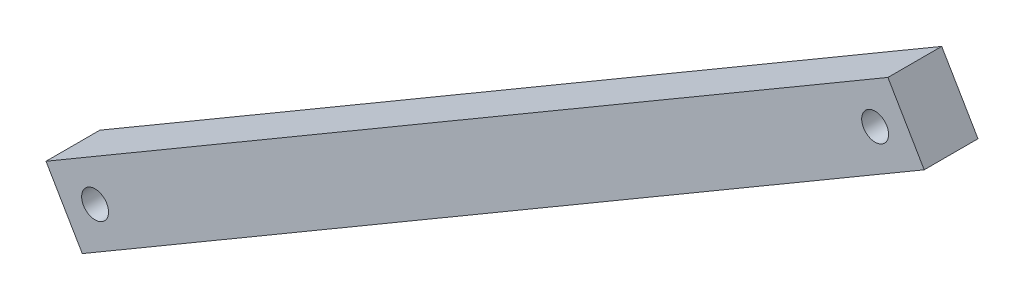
ISO-10303-21;
HEADER;
FILE_DESCRIPTION(('STEP AP214'),'2;1');
FILE_NAME('part.step','',(''),(''),'','','');
FILE_SCHEMA(('AUTOMOTIVE_DESIGN { 1 0 10303 214 1 1 1 1 }'));
ENDSEC;
DATA;
#1=APPLICATION_CONTEXT('core data for automotive mechanical design processes');
#2=APPLICATION_PROTOCOL_DEFINITION('international standard','automotive_design',2000,#1);
#3=PRODUCT_CONTEXT('',#1,'mechanical');
#4=PRODUCT('Part','Part','',(#3));
#5=PRODUCT_RELATED_PRODUCT_CATEGORY('part','',(#4));
#6=PRODUCT_DEFINITION_FORMATION('','',#4);
#7=PRODUCT_DEFINITION_CONTEXT('part definition',#1,'design');
#8=PRODUCT_DEFINITION('design','',#6,#7);
#9=PRODUCT_DEFINITION_SHAPE('','',#8);
#10=(LENGTH_UNIT() NAMED_UNIT(*) SI_UNIT(.MILLI.,.METRE.));
#11=(NAMED_UNIT(*) PLANE_ANGLE_UNIT() SI_UNIT($,.RADIAN.));
#12=(NAMED_UNIT(*) SI_UNIT($,.STERADIAN.) SOLID_ANGLE_UNIT());
#13=UNCERTAINTY_MEASURE_WITH_UNIT(LENGTH_MEASURE(1.E-05),#10,'distance_accuracy_value','');
#14=(GEOMETRIC_REPRESENTATION_CONTEXT(3) GLOBAL_UNCERTAINTY_ASSIGNED_CONTEXT((#13)) GLOBAL_UNIT_ASSIGNED_CONTEXT((#10,
#11,#12)) REPRESENTATION_CONTEXT('',''));
#15=CARTESIAN_POINT('',(0.,0.,0.));
#16=DIRECTION('',(0.,0.,1.));
#17=DIRECTION('',(1.,0.,0.));
#18=AXIS2_PLACEMENT_3D('',#15,#16,#17);
#19=CARTESIAN_POINT('',(-1.42791388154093,30.5263301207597,6.));
#20=DIRECTION('',(0.,0.,-1.));
#21=DIRECTION('',(-1.,0.,0.));
#22=AXIS2_PLACEMENT_3D('',#19,#20,#21);
#23=PLANE('',#22);
#24=CARTESIAN_POINT('',(87.,87.,6.));
#25=DIRECTION('',(0.,0.,1.));
#26=DIRECTION('',(1.,0.,0.));
#27=AXIS2_PLACEMENT_3D('',#24,#25,#26);
#28=CIRCLE('',#27,1.5);
#29=CARTESIAN_POINT('',(88.5,87.,6.));
#30=VERTEX_POINT('',#29);
#31=EDGE_CURVE('E85',#30,#30,#28,.T.);
#32=ORIENTED_EDGE('',*,*,#31,.F.);
#33=EDGE_LOOP('',(#32));
#34=FACE_BOUND('',#33,.T.);
#35=DIRECTION('',(0.505719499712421,-0.862697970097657,0.));
#36=VECTOR('',#35,1.);
#37=CARTESIAN_POINT('',(-5.47366987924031,37.427913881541,6.));
#38=LINE('',#37,#36);
#39=CARTESIAN_POINT('',(-5.47366987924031,37.427913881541,6.));
#40=VERTEX_POINT('',#39);
#41=CARTESIAN_POINT('',(-1.42791388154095,30.5263301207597,6.));
#42=VERTEX_POINT('',#41);
#43=EDGE_CURVE('E95',#40,#42,#38,.T.);
#44=ORIENTED_EDGE('',*,*,#43,.T.);
#45=DIRECTION('',(0.862697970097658,0.50571949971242,0.));
#46=VECTOR('',#45,1.);
#47=CARTESIAN_POINT('',(92.4736698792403,85.5720861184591,6.));
#48=LINE('',#47,#46);
#49=CARTESIAN_POINT('',(92.4736698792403,85.5720861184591,6.));
#50=VERTEX_POINT('',#49);
#51=EDGE_CURVE('E80',#42,#50,#48,.T.);
#52=ORIENTED_EDGE('',*,*,#51,.T.);
#53=DIRECTION('',(-0.50571949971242,0.862697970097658,0.));
#54=VECTOR('',#53,1.);
#55=CARTESIAN_POINT('',(88.427913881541,92.4736698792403,6.));
#56=LINE('',#55,#54);
#57=CARTESIAN_POINT('',(88.427913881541,92.4736698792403,6.));
#58=VERTEX_POINT('',#57);
#59=EDGE_CURVE('E46',#50,#58,#56,.T.);
#60=ORIENTED_EDGE('',*,*,#59,.T.);
#61=DIRECTION('',(-0.862697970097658,-0.50571949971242,0.));
#62=VECTOR('',#61,1.);
#63=CARTESIAN_POINT('',(-5.47366987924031,37.427913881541,6.));
#64=LINE('',#63,#62);
#65=EDGE_CURVE('E41',#58,#40,#64,.T.);
#66=ORIENTED_EDGE('',*,*,#65,.T.);
#67=EDGE_LOOP('',(#44,#52,#60,#66));
#68=FACE_BOUND('',#67,.T.);
#69=CARTESIAN_POINT('',(0.,36.,6.));
#70=DIRECTION('',(0.,0.,1.));
#71=DIRECTION('',(1.,0.,0.));
#72=AXIS2_PLACEMENT_3D('',#69,#70,#71);
#73=CIRCLE('',#72,1.5);
#74=CARTESIAN_POINT('',(1.5,36.,6.));
#75=VERTEX_POINT('',#74);
#76=EDGE_CURVE('E113',#75,#75,#73,.T.);
#77=ORIENTED_EDGE('',*,*,#76,.F.);
#78=EDGE_LOOP('',(#77));
#79=FACE_BOUND('',#78,.T.);
#80=ADVANCED_FACE('F26',(#34,#68,#79),#23,.F.);
#81=CARTESIAN_POINT('',(-1.42791388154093,30.5263301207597,0.));
#82=DIRECTION('',(0.,0.,-1.));
#83=DIRECTION('',(-1.,0.,0.));
#84=AXIS2_PLACEMENT_3D('',#81,#82,#83);
#85=PLANE('',#84);
#86=CARTESIAN_POINT('',(87.,87.,0.));
#87=DIRECTION('',(0.,0.,1.));
#88=DIRECTION('',(1.,0.,0.));
#89=AXIS2_PLACEMENT_3D('',#86,#87,#88);
#90=CIRCLE('',#89,1.5);
#91=CARTESIAN_POINT('',(88.5,87.,0.));
#92=VERTEX_POINT('',#91);
#93=EDGE_CURVE('E88',#92,#92,#90,.T.);
#94=ORIENTED_EDGE('',*,*,#93,.T.);
#95=EDGE_LOOP('',(#94));
#96=FACE_BOUND('',#95,.T.);
#97=DIRECTION('',(0.505719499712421,-0.862697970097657,0.));
#98=VECTOR('',#97,1.);
#99=CARTESIAN_POINT('',(-5.47366987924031,37.427913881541,0.));
#100=LINE('',#99,#98);
#101=CARTESIAN_POINT('',(-5.47366987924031,37.427913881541,0.));
#102=VERTEX_POINT('',#101);
#103=CARTESIAN_POINT('',(-1.42791388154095,30.5263301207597,0.));
#104=VERTEX_POINT('',#103);
#105=EDGE_CURVE('E72',#102,#104,#100,.T.);
#106=ORIENTED_EDGE('',*,*,#105,.F.);
#107=DIRECTION('',(-0.862697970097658,-0.50571949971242,0.));
#108=VECTOR('',#107,1.);
#109=CARTESIAN_POINT('',(-5.47366987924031,37.427913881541,0.));
#110=LINE('',#109,#108);
#111=CARTESIAN_POINT('',(88.427913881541,92.4736698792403,0.));
#112=VERTEX_POINT('',#111);
#113=EDGE_CURVE('E93',#112,#102,#110,.T.);
#114=ORIENTED_EDGE('',*,*,#113,.F.);
#115=DIRECTION('',(-0.50571949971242,0.862697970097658,0.));
#116=VECTOR('',#115,1.);
#117=CARTESIAN_POINT('',(88.427913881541,92.4736698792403,0.));
#118=LINE('',#117,#116);
#119=CARTESIAN_POINT('',(92.4736698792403,85.5720861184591,0.));
#120=VERTEX_POINT('',#119);
#121=EDGE_CURVE('E73',#120,#112,#118,.T.);
#122=ORIENTED_EDGE('',*,*,#121,.F.);
#123=DIRECTION('',(0.862697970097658,0.50571949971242,0.));
#124=VECTOR('',#123,1.);
#125=CARTESIAN_POINT('',(92.4736698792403,85.5720861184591,0.));
#126=LINE('',#125,#124);
#127=EDGE_CURVE('E67',#104,#120,#126,.T.);
#128=ORIENTED_EDGE('',*,*,#127,.F.);
#129=EDGE_LOOP('',(#106,#114,#122,#128));
#130=FACE_BOUND('',#129,.T.);
#131=CARTESIAN_POINT('',(0.,36.,0.));
#132=DIRECTION('',(0.,0.,1.));
#133=DIRECTION('',(1.,0.,0.));
#134=AXIS2_PLACEMENT_3D('',#131,#132,#133);
#135=CIRCLE('',#134,1.5);
#136=CARTESIAN_POINT('',(1.5,36.,0.));
#137=VERTEX_POINT('',#136);
#138=EDGE_CURVE('E115',#137,#137,#135,.T.);
#139=ORIENTED_EDGE('',*,*,#138,.T.);
#140=EDGE_LOOP('',(#139));
#141=FACE_BOUND('',#140,.T.);
#142=ADVANCED_FACE('F68',(#96,#130,#141),#85,.T.);
#143=CARTESIAN_POINT('',(-5.47366987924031,37.427913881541,6.));
#144=DIRECTION('',(0.862697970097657,0.505719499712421,0.));
#145=DIRECTION('',(-0.505719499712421,0.862697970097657,0.));
#146=AXIS2_PLACEMENT_3D('',#143,#144,#145);
#147=PLANE('',#146);
#148=ORIENTED_EDGE('',*,*,#105,.T.);
#149=DIRECTION('',(0.,0.,-1.));
#150=VECTOR('',#149,1.);
#151=CARTESIAN_POINT('',(-1.42791388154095,30.5263301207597,6.));
#152=LINE('',#151,#150);
#153=EDGE_CURVE('E11',#42,#104,#152,.T.);
#154=ORIENTED_EDGE('',*,*,#153,.F.);
#155=ORIENTED_EDGE('',*,*,#43,.F.);
#156=DIRECTION('',(0.,0.,-1.));
#157=VECTOR('',#156,1.);
#158=CARTESIAN_POINT('',(-5.47366987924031,37.427913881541,6.));
#159=LINE('',#158,#157);
#160=EDGE_CURVE('E84',#40,#102,#159,.T.);
#161=ORIENTED_EDGE('',*,*,#160,.T.);
#162=EDGE_LOOP('',(#148,#154,#155,#161));
#163=FACE_BOUND('',#162,.T.);
#164=ADVANCED_FACE('F28',(#163),#147,.F.);
#165=CARTESIAN_POINT('',(92.4736698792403,85.5720861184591,6.));
#166=DIRECTION('',(-0.50571949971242,0.862697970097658,0.));
#167=DIRECTION('',(-0.862697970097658,-0.50571949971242,0.));
#168=AXIS2_PLACEMENT_3D('',#165,#166,#167);
#169=PLANE('',#168);
#170=ORIENTED_EDGE('',*,*,#127,.T.);
#171=DIRECTION('',(0.,0.,-1.));
#172=VECTOR('',#171,1.);
#173=CARTESIAN_POINT('',(92.4736698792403,85.5720861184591,6.));
#174=LINE('',#173,#172);
#175=EDGE_CURVE('E34',#50,#120,#174,.T.);
#176=ORIENTED_EDGE('',*,*,#175,.F.);
#177=ORIENTED_EDGE('',*,*,#51,.F.);
#178=ORIENTED_EDGE('',*,*,#153,.T.);
#179=EDGE_LOOP('',(#170,#176,#177,#178));
#180=FACE_BOUND('',#179,.T.);
#181=ADVANCED_FACE('F79',(#180),#169,.F.);
#182=CARTESIAN_POINT('',(88.427913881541,92.4736698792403,6.));
#183=DIRECTION('',(-0.862697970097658,-0.50571949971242,0.));
#184=DIRECTION('',(0.50571949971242,-0.862697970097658,0.));
#185=AXIS2_PLACEMENT_3D('',#182,#183,#184);
#186=PLANE('',#185);
#187=ORIENTED_EDGE('',*,*,#121,.T.);
#188=DIRECTION('',(0.,0.,-1.));
#189=VECTOR('',#188,1.);
#190=CARTESIAN_POINT('',(88.427913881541,92.4736698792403,6.));
#191=LINE('',#190,#189);
#192=EDGE_CURVE('E101',#58,#112,#191,.T.);
#193=ORIENTED_EDGE('',*,*,#192,.F.);
#194=ORIENTED_EDGE('',*,*,#59,.F.);
#195=ORIENTED_EDGE('',*,*,#175,.T.);
#196=EDGE_LOOP('',(#187,#193,#194,#195));
#197=FACE_BOUND('',#196,.T.);
#198=ADVANCED_FACE('F104',(#197),#186,.F.);
#199=CARTESIAN_POINT('',(-5.47366987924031,37.427913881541,6.));
#200=DIRECTION('',(0.50571949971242,-0.862697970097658,0.));
#201=DIRECTION('',(0.862697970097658,0.50571949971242,0.));
#202=AXIS2_PLACEMENT_3D('',#199,#200,#201);
#203=PLANE('',#202);
#204=ORIENTED_EDGE('',*,*,#113,.T.);
#205=ORIENTED_EDGE('',*,*,#160,.F.);
#206=ORIENTED_EDGE('',*,*,#65,.F.);
#207=ORIENTED_EDGE('',*,*,#192,.T.);
#208=EDGE_LOOP('',(#204,#205,#206,#207));
#209=FACE_BOUND('',#208,.T.);
#210=ADVANCED_FACE('F106',(#209),#203,.F.);
#211=CARTESIAN_POINT('',(87.,87.,6.));
#212=DIRECTION('',(0.,0.,-1.));
#213=DIRECTION('',(-1.,0.,0.));
#214=AXIS2_PLACEMENT_3D('',#211,#212,#213);
#215=CYLINDRICAL_SURFACE('',#214,1.5);
#216=ORIENTED_EDGE('',*,*,#31,.T.);
#217=EDGE_LOOP('',(#216));
#218=FACE_BOUND('',#217,.T.);
#219=ORIENTED_EDGE('',*,*,#93,.F.);
#220=EDGE_LOOP('',(#219));
#221=FACE_BOUND('',#220,.T.);
#222=ADVANCED_FACE('F124',(#218,#221),#215,.F.);
#223=CARTESIAN_POINT('',(0.,36.,6.));
#224=DIRECTION('',(0.,0.,-1.));
#225=DIRECTION('',(-1.,0.,0.));
#226=AXIS2_PLACEMENT_3D('',#223,#224,#225);
#227=CYLINDRICAL_SURFACE('',#226,1.5);
#228=ORIENTED_EDGE('',*,*,#76,.T.);
#229=EDGE_LOOP('',(#228));
#230=FACE_BOUND('',#229,.T.);
#231=ORIENTED_EDGE('',*,*,#138,.F.);
#232=EDGE_LOOP('',(#231));
#233=FACE_BOUND('',#232,.T.);
#234=ADVANCED_FACE('F122',(#230,#233),#227,.F.);
#235=CLOSED_SHELL('',(#80,#142,#164,#181,#198,#210,#222,#234));
#236=MANIFOLD_SOLID_BREP('B2',#235);
#237=ADVANCED_BREP_SHAPE_REPRESENTATION('',(#18,#236),#14);
#238=SHAPE_DEFINITION_REPRESENTATION(#9,#237);
ENDSEC;
END-ISO-10303-21;
